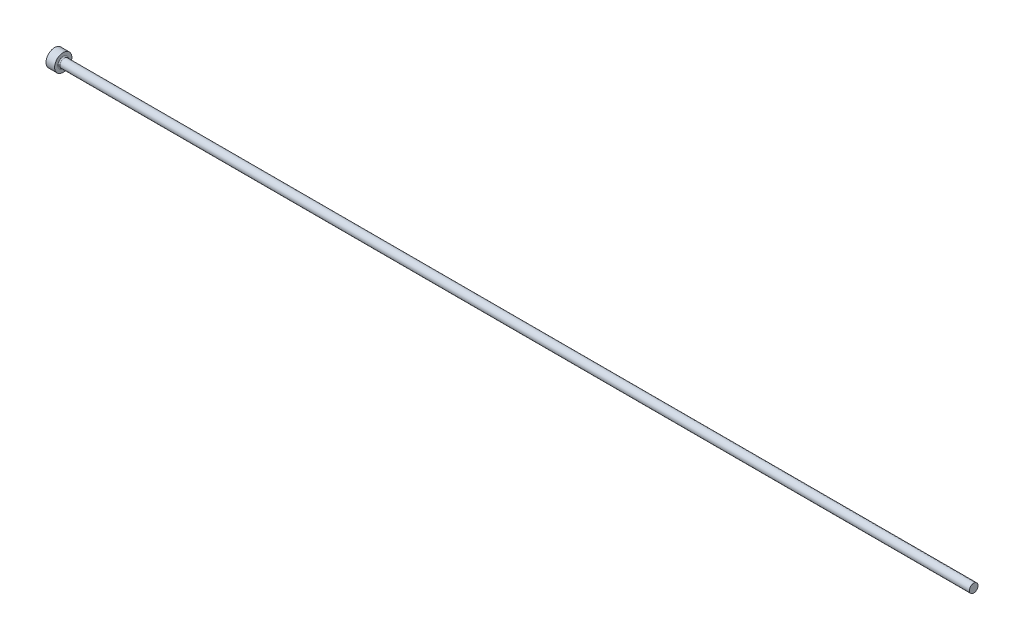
ISO-10303-21;
HEADER;
FILE_DESCRIPTION(('STEP AP214'),'2;1');
FILE_NAME('part.step','',(''),(''),'','','');
FILE_SCHEMA(('AUTOMOTIVE_DESIGN { 1 0 10303 214 1 1 1 1 }'));
ENDSEC;
DATA;
#1=APPLICATION_CONTEXT('core data for automotive mechanical design processes');
#2=APPLICATION_PROTOCOL_DEFINITION('international standard','automotive_design',2000,#1);
#3=PRODUCT_CONTEXT('',#1,'mechanical');
#4=PRODUCT('Part','Part','',(#3));
#5=PRODUCT_RELATED_PRODUCT_CATEGORY('part','',(#4));
#6=PRODUCT_DEFINITION_FORMATION('','',#4);
#7=PRODUCT_DEFINITION_CONTEXT('part definition',#1,'design');
#8=PRODUCT_DEFINITION('design','',#6,#7);
#9=PRODUCT_DEFINITION_SHAPE('','',#8);
#10=(LENGTH_UNIT() NAMED_UNIT(*) SI_UNIT(.MILLI.,.METRE.));
#11=(NAMED_UNIT(*) PLANE_ANGLE_UNIT() SI_UNIT($,.RADIAN.));
#12=(NAMED_UNIT(*) SI_UNIT($,.STERADIAN.) SOLID_ANGLE_UNIT());
#13=UNCERTAINTY_MEASURE_WITH_UNIT(LENGTH_MEASURE(1.E-05),#10,'distance_accuracy_value','');
#14=(GEOMETRIC_REPRESENTATION_CONTEXT(3) GLOBAL_UNCERTAINTY_ASSIGNED_CONTEXT((#13)) GLOBAL_UNIT_ASSIGNED_CONTEXT((#10,
#11,#12)) REPRESENTATION_CONTEXT('',''));
#15=CARTESIAN_POINT('',(0.,0.,0.));
#16=DIRECTION('',(0.,0.,1.));
#17=DIRECTION('',(1.,0.,0.));
#18=AXIS2_PLACEMENT_3D('',#15,#16,#17);
#19=CARTESIAN_POINT('',(0.,0.,0.));
#20=DIRECTION('',(-1.,0.,0.));
#21=DIRECTION('',(0.,-1.,0.));
#22=AXIS2_PLACEMENT_3D('',#19,#20,#21);
#23=PLANE('',#22);
#24=CARTESIAN_POINT('',(0.,0.,0.));
#25=DIRECTION('',(1.,0.,0.));
#26=DIRECTION('',(0.,1.,0.));
#27=AXIS2_PLACEMENT_3D('',#24,#25,#26);
#28=CIRCLE('',#27,1.5);
#29=CARTESIAN_POINT('',(0.,1.5,0.));
#30=VERTEX_POINT('',#29);
#31=EDGE_CURVE('E25',#30,#30,#28,.T.);
#32=ORIENTED_EDGE('',*,*,#31,.F.);
#33=EDGE_LOOP('',(#32));
#34=FACE_BOUND('',#33,.T.);
#35=ADVANCED_FACE('F14',(#34),#23,.T.);
#36=CARTESIAN_POINT('',(160.,0.,0.));
#37=DIRECTION('',(1.,0.,0.));
#38=DIRECTION('',(0.,1.,0.));
#39=AXIS2_PLACEMENT_3D('',#36,#37,#38);
#40=CYLINDRICAL_SURFACE('',#39,1.5);
#41=ORIENTED_EDGE('',*,*,#31,.T.);
#42=EDGE_LOOP('',(#41));
#43=FACE_BOUND('',#42,.T.);
#44=CARTESIAN_POINT('',(1.5,0.,0.));
#45=DIRECTION('',(1.,0.,0.));
#46=DIRECTION('',(0.,1.,0.));
#47=AXIS2_PLACEMENT_3D('',#44,#45,#46);
#48=CIRCLE('',#47,1.5);
#49=CARTESIAN_POINT('',(1.5,1.5,0.));
#50=VERTEX_POINT('',#49);
#51=EDGE_CURVE('E29',#50,#50,#48,.T.);
#52=ORIENTED_EDGE('',*,*,#51,.F.);
#53=EDGE_LOOP('',(#52));
#54=FACE_BOUND('',#53,.T.);
#55=ADVANCED_FACE('F51',(#43,#54),#40,.T.);
#56=CARTESIAN_POINT('',(1.5,1.5,0.));
#57=DIRECTION('',(1.,0.,0.));
#58=DIRECTION('',(0.,1.,0.));
#59=AXIS2_PLACEMENT_3D('',#56,#57,#58);
#60=PLANE('',#59);
#61=CARTESIAN_POINT('',(1.5,0.,0.));
#62=DIRECTION('',(1.,0.,0.));
#63=DIRECTION('',(0.,1.,0.));
#64=AXIS2_PLACEMENT_3D('',#61,#62,#63);
#65=CIRCLE('',#64,0.949999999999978);
#66=CARTESIAN_POINT('',(1.5,0.949999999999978,0.));
#67=VERTEX_POINT('',#66);
#68=EDGE_CURVE('E9',#67,#67,#65,.F.);
#69=ORIENTED_EDGE('',*,*,#68,.T.);
#70=EDGE_LOOP('',(#69));
#71=FACE_BOUND('',#70,.T.);
#72=ORIENTED_EDGE('',*,*,#51,.T.);
#73=EDGE_LOOP('',(#72));
#74=FACE_BOUND('',#73,.T.);
#75=ADVANCED_FACE('F42',(#71,#74),#60,.T.);
#76=CARTESIAN_POINT('',(160.,0.,0.));
#77=DIRECTION('',(1.,0.,0.));
#78=DIRECTION('',(0.,1.,0.));
#79=AXIS2_PLACEMENT_3D('',#76,#77,#78);
#80=CYLINDRICAL_SURFACE('',#79,0.749999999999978);
#81=CARTESIAN_POINT('',(1.7,0.,0.));
#82=DIRECTION('',(1.,0.,0.));
#83=DIRECTION('',(0.,1.,0.));
#84=AXIS2_PLACEMENT_3D('',#81,#82,#83);
#85=CIRCLE('',#84,0.749999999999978);
#86=CARTESIAN_POINT('',(1.7,0.749999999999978,0.));
#87=VERTEX_POINT('',#86);
#88=EDGE_CURVE('E21',#87,#87,#85,.T.);
#89=ORIENTED_EDGE('',*,*,#88,.T.);
#90=EDGE_LOOP('',(#89));
#91=FACE_BOUND('',#90,.T.);
#92=CARTESIAN_POINT('',(160.,0.,0.));
#93=DIRECTION('',(1.,0.,0.));
#94=DIRECTION('',(0.,1.,0.));
#95=AXIS2_PLACEMENT_3D('',#92,#93,#94);
#96=CIRCLE('',#95,0.749999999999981);
#97=CARTESIAN_POINT('',(160.,0.749999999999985,0.));
#98=VERTEX_POINT('',#97);
#99=EDGE_CURVE('E34',#98,#98,#96,.T.);
#100=ORIENTED_EDGE('',*,*,#99,.F.);
#101=EDGE_LOOP('',(#100));
#102=FACE_BOUND('',#101,.T.);
#103=ADVANCED_FACE('F40',(#91,#102),#80,.T.);
#104=CARTESIAN_POINT('',(160.,0.749999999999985,0.));
#105=DIRECTION('',(1.,0.,0.));
#106=DIRECTION('',(0.,1.,0.));
#107=AXIS2_PLACEMENT_3D('',#104,#105,#106);
#108=PLANE('',#107);
#109=ORIENTED_EDGE('',*,*,#99,.T.);
#110=EDGE_LOOP('',(#109));
#111=FACE_BOUND('',#110,.T.);
#112=ADVANCED_FACE('F38',(#111),#108,.T.);
#113=CARTESIAN_POINT('',(1.7,0.,0.));
#114=DIRECTION('',(1.,0.,0.));
#115=DIRECTION('',(0.,1.,0.));
#116=AXIS2_PLACEMENT_3D('',#113,#114,#115);
#117=TOROIDAL_SURFACE('',#116,0.949999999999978,0.2);
#118=ORIENTED_EDGE('',*,*,#68,.F.);
#119=EDGE_LOOP('',(#118));
#120=FACE_BOUND('',#119,.T.);
#121=ORIENTED_EDGE('',*,*,#88,.F.);
#122=EDGE_LOOP('',(#121));
#123=FACE_BOUND('',#122,.T.);
#124=ADVANCED_FACE('F16',(#120,#123),#117,.F.);
#125=CLOSED_SHELL('',(#35,#55,#75,#103,#112,#124));
#126=MANIFOLD_SOLID_BREP('B1',#125);
#127=ADVANCED_BREP_SHAPE_REPRESENTATION('',(#18,#126),#14);
#128=SHAPE_DEFINITION_REPRESENTATION(#9,#127);
ENDSEC;
END-ISO-10303-21;
